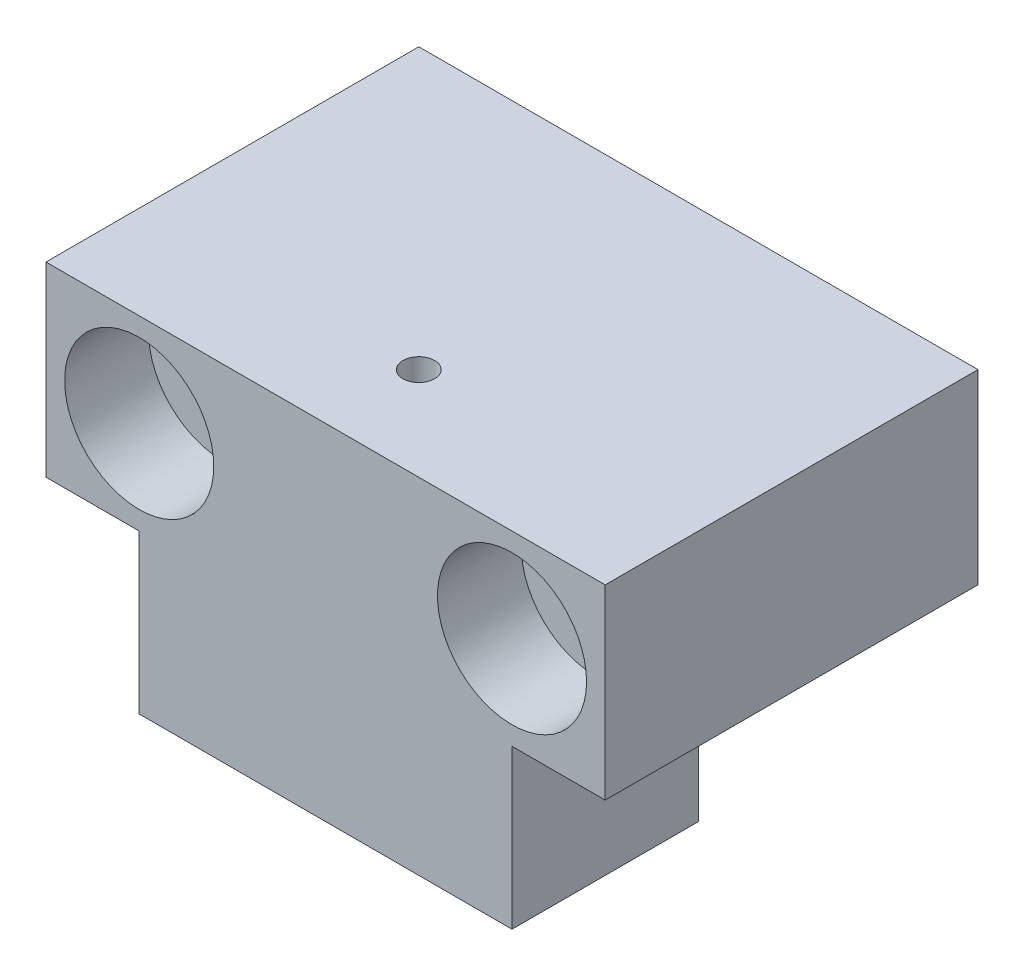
ISO-10303-21;
HEADER;
FILE_DESCRIPTION(('STEP AP214'),'2;1');
FILE_NAME('part.step','',(''),(''),'','','');
FILE_SCHEMA(('AUTOMOTIVE_DESIGN { 1 0 10303 214 1 1 1 1 }'));
ENDSEC;
DATA;
#1=APPLICATION_CONTEXT('core data for automotive mechanical design processes');
#2=APPLICATION_PROTOCOL_DEFINITION('international standard','automotive_design',2000,#1);
#3=PRODUCT_CONTEXT('',#1,'mechanical');
#4=PRODUCT('Part','Part','',(#3));
#5=PRODUCT_RELATED_PRODUCT_CATEGORY('part','',(#4));
#6=PRODUCT_DEFINITION_FORMATION('','',#4);
#7=PRODUCT_DEFINITION_CONTEXT('part definition',#1,'design');
#8=PRODUCT_DEFINITION('design','',#6,#7);
#9=PRODUCT_DEFINITION_SHAPE('','',#8);
#10=(LENGTH_UNIT() NAMED_UNIT(*) SI_UNIT(.MILLI.,.METRE.));
#11=(NAMED_UNIT(*) PLANE_ANGLE_UNIT() SI_UNIT($,.RADIAN.));
#12=(NAMED_UNIT(*) SI_UNIT($,.STERADIAN.) SOLID_ANGLE_UNIT());
#13=UNCERTAINTY_MEASURE_WITH_UNIT(LENGTH_MEASURE(1.E-05),#10,'distance_accuracy_value','');
#14=(GEOMETRIC_REPRESENTATION_CONTEXT(3) GLOBAL_UNCERTAINTY_ASSIGNED_CONTEXT((#13)) GLOBAL_UNIT_ASSIGNED_CONTEXT((#10,
#11,#12)) REPRESENTATION_CONTEXT('',''));
#15=CARTESIAN_POINT('',(0.,0.,0.));
#16=DIRECTION('',(0.,0.,1.));
#17=DIRECTION('',(1.,0.,0.));
#18=AXIS2_PLACEMENT_3D('',#15,#16,#17);
#19=CARTESIAN_POINT('',(25.0000000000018,13.5,20.));
#20=DIRECTION('',(0.,0.,-1.));
#21=DIRECTION('',(-1.,0.,0.));
#22=AXIS2_PLACEMENT_3D('',#19,#20,#21);
#23=CYLINDRICAL_SURFACE('',#22,2.25);
#24=CARTESIAN_POINT('',(25.0000000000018,13.5,0.));
#25=DIRECTION('',(0.,0.,1.));
#26=DIRECTION('',(1.,0.,0.));
#27=AXIS2_PLACEMENT_3D('',#24,#25,#26);
#28=CIRCLE('',#27,2.25);
#29=CARTESIAN_POINT('',(27.2500000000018,13.5,0.));
#30=VERTEX_POINT('',#29);
#31=EDGE_CURVE('E140',#30,#30,#28,.T.);
#32=ORIENTED_EDGE('',*,*,#31,.F.);
#33=EDGE_LOOP('',(#32));
#34=FACE_BOUND('',#33,.T.);
#35=CARTESIAN_POINT('',(25.0000000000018,13.5,15.5));
#36=DIRECTION('',(0.,0.,1.));
#37=DIRECTION('',(1.,0.,0.));
#38=AXIS2_PLACEMENT_3D('',#35,#36,#37);
#39=CIRCLE('',#38,2.25);
#40=CARTESIAN_POINT('',(27.2500000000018,13.5,15.5));
#41=VERTEX_POINT('',#40);
#42=EDGE_CURVE('E36',#41,#41,#39,.T.);
#43=ORIENTED_EDGE('',*,*,#42,.T.);
#44=EDGE_LOOP('',(#43));
#45=FACE_BOUND('',#44,.T.);
#46=ADVANCED_FACE('F32',(#34,#45),#23,.F.);
#47=CARTESIAN_POINT('',(5.00000000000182,13.5,20.));
#48=DIRECTION('',(0.,0.,-1.));
#49=DIRECTION('',(-1.,0.,0.));
#50=AXIS2_PLACEMENT_3D('',#47,#48,#49);
#51=CYLINDRICAL_SURFACE('',#50,2.25);
#52=CARTESIAN_POINT('',(5.00000000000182,13.5,0.));
#53=DIRECTION('',(0.,0.,1.));
#54=DIRECTION('',(1.,0.,0.));
#55=AXIS2_PLACEMENT_3D('',#52,#53,#54);
#56=CIRCLE('',#55,2.25);
#57=CARTESIAN_POINT('',(7.25000000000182,13.5,0.));
#58=VERTEX_POINT('',#57);
#59=EDGE_CURVE('E123',#58,#58,#56,.T.);
#60=ORIENTED_EDGE('',*,*,#59,.F.);
#61=EDGE_LOOP('',(#60));
#62=FACE_BOUND('',#61,.T.);
#63=CARTESIAN_POINT('',(5.00000000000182,13.5,15.5));
#64=DIRECTION('',(0.,0.,1.));
#65=DIRECTION('',(1.,0.,0.));
#66=AXIS2_PLACEMENT_3D('',#63,#64,#65);
#67=CIRCLE('',#66,2.25);
#68=CARTESIAN_POINT('',(7.25000000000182,13.5,15.5));
#69=VERTEX_POINT('',#68);
#70=EDGE_CURVE('E138',#69,#69,#67,.T.);
#71=ORIENTED_EDGE('',*,*,#70,.T.);
#72=EDGE_LOOP('',(#71));
#73=FACE_BOUND('',#72,.T.);
#74=ADVANCED_FACE('F221',(#62,#73),#51,.F.);
#75=CARTESIAN_POINT('',(1.81898940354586E-12,18.5,20.));
#76=DIRECTION('',(0.,0.,-1.));
#77=DIRECTION('',(-1.,0.,0.));
#78=AXIS2_PLACEMENT_3D('',#75,#76,#77);
#79=PLANE('',#78);
#80=CARTESIAN_POINT('',(25.0000000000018,13.5,20.));
#81=DIRECTION('',(0.,0.,1.));
#82=DIRECTION('',(1.,0.,0.));
#83=AXIS2_PLACEMENT_3D('',#80,#81,#82);
#84=CIRCLE('',#83,4.);
#85=CARTESIAN_POINT('',(29.0000000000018,13.5,20.));
#86=VERTEX_POINT('',#85);
#87=EDGE_CURVE('E154',#86,#86,#84,.T.);
#88=ORIENTED_EDGE('',*,*,#87,.F.);
#89=EDGE_LOOP('',(#88));
#90=FACE_BOUND('',#89,.T.);
#91=CARTESIAN_POINT('',(5.00000000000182,13.5,20.));
#92=DIRECTION('',(0.,0.,1.));
#93=DIRECTION('',(1.,0.,0.));
#94=AXIS2_PLACEMENT_3D('',#91,#92,#93);
#95=CIRCLE('',#94,4.);
#96=CARTESIAN_POINT('',(9.00000000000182,13.5,20.));
#97=VERTEX_POINT('',#96);
#98=EDGE_CURVE('E147',#97,#97,#95,.T.);
#99=ORIENTED_EDGE('',*,*,#98,.F.);
#100=EDGE_LOOP('',(#99));
#101=FACE_BOUND('',#100,.T.);
#102=DIRECTION('',(0.,-1.,0.));
#103=VECTOR('',#102,1.);
#104=CARTESIAN_POINT('',(1.81898940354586E-12,8.5,20.));
#105=LINE('',#104,#103);
#106=CARTESIAN_POINT('',(1.81898940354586E-12,18.5,20.));
#107=VERTEX_POINT('',#106);
#108=CARTESIAN_POINT('',(1.81898940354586E-12,8.5,20.));
#109=VERTEX_POINT('',#108);
#110=EDGE_CURVE('E127',#107,#109,#105,.T.);
#111=ORIENTED_EDGE('',*,*,#110,.T.);
#112=DIRECTION('',(1.,0.,0.));
#113=VECTOR('',#112,1.);
#114=CARTESIAN_POINT('',(1.81898940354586E-12,8.5,20.));
#115=LINE('',#114,#113);
#116=CARTESIAN_POINT('',(5.00000000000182,8.5,20.));
#117=VERTEX_POINT('',#116);
#118=EDGE_CURVE('E81',#109,#117,#115,.T.);
#119=ORIENTED_EDGE('',*,*,#118,.T.);
#120=DIRECTION('',(0.,-1.,0.));
#121=VECTOR('',#120,1.);
#122=CARTESIAN_POINT('',(5.00000000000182,0.,20.));
#123=LINE('',#122,#121);
#124=CARTESIAN_POINT('',(5.00000000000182,0.,20.));
#125=VERTEX_POINT('',#124);
#126=EDGE_CURVE('E161',#117,#125,#123,.T.);
#127=ORIENTED_EDGE('',*,*,#126,.T.);
#128=DIRECTION('',(1.,0.,0.));
#129=VECTOR('',#128,1.);
#130=CARTESIAN_POINT('',(5.00000000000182,0.,20.));
#131=LINE('',#130,#129);
#132=CARTESIAN_POINT('',(25.0000000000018,0.,20.));
#133=VERTEX_POINT('',#132);
#134=EDGE_CURVE('E163',#125,#133,#131,.T.);
#135=ORIENTED_EDGE('',*,*,#134,.T.);
#136=DIRECTION('',(0.,1.,0.));
#137=VECTOR('',#136,1.);
#138=CARTESIAN_POINT('',(25.0000000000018,0.,20.));
#139=LINE('',#138,#137);
#140=CARTESIAN_POINT('',(25.0000000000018,8.5,20.));
#141=VERTEX_POINT('',#140);
#142=EDGE_CURVE('E102',#133,#141,#139,.T.);
#143=ORIENTED_EDGE('',*,*,#142,.T.);
#144=DIRECTION('',(1.,0.,0.));
#145=VECTOR('',#144,1.);
#146=CARTESIAN_POINT('',(25.0000000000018,8.5,20.));
#147=LINE('',#146,#145);
#148=CARTESIAN_POINT('',(30.0000000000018,8.5,20.));
#149=VERTEX_POINT('',#148);
#150=EDGE_CURVE('E96',#141,#149,#147,.T.);
#151=ORIENTED_EDGE('',*,*,#150,.T.);
#152=DIRECTION('',(0.,1.,0.));
#153=VECTOR('',#152,1.);
#154=CARTESIAN_POINT('',(30.0000000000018,8.5,20.));
#155=LINE('',#154,#153);
#156=CARTESIAN_POINT('',(30.0000000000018,18.5,20.));
#157=VERTEX_POINT('',#156);
#158=EDGE_CURVE('E100',#149,#157,#155,.T.);
#159=ORIENTED_EDGE('',*,*,#158,.T.);
#160=DIRECTION('',(-1.,0.,0.));
#161=VECTOR('',#160,1.);
#162=CARTESIAN_POINT('',(1.81898940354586E-12,18.5,20.));
#163=LINE('',#162,#161);
#164=EDGE_CURVE('E51',#157,#107,#163,.T.);
#165=ORIENTED_EDGE('',*,*,#164,.T.);
#166=EDGE_LOOP('',(#111,#119,#127,#135,#143,#151,#159,#165));
#167=FACE_BOUND('',#166,.T.);
#168=ADVANCED_FACE('F98',(#90,#101,#167),#79,.F.);
#169=CARTESIAN_POINT('',(1.81898940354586E-12,18.5,0.));
#170=DIRECTION('',(0.,0.,-1.));
#171=DIRECTION('',(-1.,0.,0.));
#172=AXIS2_PLACEMENT_3D('',#169,#170,#171);
#173=PLANE('',#172);
#174=DIRECTION('',(1.,0.,0.));
#175=VECTOR('',#174,1.);
#176=CARTESIAN_POINT('',(25.0000000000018,8.5,0.));
#177=LINE('',#176,#175);
#178=CARTESIAN_POINT('',(1.81898940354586E-12,8.5,0.));
#179=VERTEX_POINT('',#178);
#180=CARTESIAN_POINT('',(30.0000000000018,8.5,0.));
#181=VERTEX_POINT('',#180);
#182=EDGE_CURVE('E110',#179,#181,#177,.T.);
#183=ORIENTED_EDGE('',*,*,#182,.F.);
#184=DIRECTION('',(0.,-1.,0.));
#185=VECTOR('',#184,1.);
#186=CARTESIAN_POINT('',(1.81898940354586E-12,8.5,0.));
#187=LINE('',#186,#185);
#188=CARTESIAN_POINT('',(1.81898940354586E-12,18.5,0.));
#189=VERTEX_POINT('',#188);
#190=EDGE_CURVE('E120',#189,#179,#187,.T.);
#191=ORIENTED_EDGE('',*,*,#190,.F.);
#192=DIRECTION('',(-1.,0.,0.));
#193=VECTOR('',#192,1.);
#194=CARTESIAN_POINT('',(1.81898940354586E-12,18.5,0.));
#195=LINE('',#194,#193);
#196=CARTESIAN_POINT('',(30.0000000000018,18.5,0.));
#197=VERTEX_POINT('',#196);
#198=EDGE_CURVE('E73',#197,#189,#195,.T.);
#199=ORIENTED_EDGE('',*,*,#198,.F.);
#200=DIRECTION('',(0.,1.,0.));
#201=VECTOR('',#200,1.);
#202=CARTESIAN_POINT('',(30.0000000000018,8.5,0.));
#203=LINE('',#202,#201);
#204=EDGE_CURVE('E67',#181,#197,#203,.T.);
#205=ORIENTED_EDGE('',*,*,#204,.F.);
#206=EDGE_LOOP('',(#183,#191,#199,#205));
#207=FACE_BOUND('',#206,.T.);
#208=ORIENTED_EDGE('',*,*,#59,.T.);
#209=EDGE_LOOP('',(#208));
#210=FACE_BOUND('',#209,.T.);
#211=ORIENTED_EDGE('',*,*,#31,.T.);
#212=EDGE_LOOP('',(#211));
#213=FACE_BOUND('',#212,.T.);
#214=ADVANCED_FACE('F236',(#207,#210,#213),#173,.T.);
#215=CARTESIAN_POINT('',(1.81898940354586E-12,8.5,20.));
#216=DIRECTION('',(1.,0.,0.));
#217=DIRECTION('',(0.,0.,-1.));
#218=AXIS2_PLACEMENT_3D('',#215,#216,#217);
#219=PLANE('',#218);
#220=ORIENTED_EDGE('',*,*,#190,.T.);
#221=DIRECTION('',(0.,0.,-1.));
#222=VECTOR('',#221,1.);
#223=CARTESIAN_POINT('',(1.81898940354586E-12,8.5,20.));
#224=LINE('',#223,#222);
#225=EDGE_CURVE('E11',#109,#179,#224,.T.);
#226=ORIENTED_EDGE('',*,*,#225,.F.);
#227=ORIENTED_EDGE('',*,*,#110,.F.);
#228=DIRECTION('',(0.,0.,-1.));
#229=VECTOR('',#228,1.);
#230=CARTESIAN_POINT('',(1.81898940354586E-12,18.5,20.));
#231=LINE('',#230,#229);
#232=EDGE_CURVE('E116',#107,#189,#231,.T.);
#233=ORIENTED_EDGE('',*,*,#232,.T.);
#234=EDGE_LOOP('',(#220,#226,#227,#233));
#235=FACE_BOUND('',#234,.T.);
#236=ADVANCED_FACE('F34',(#235),#219,.F.);
#237=CARTESIAN_POINT('',(5.00000000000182,0.,20.));
#238=DIRECTION('',(1.,0.,0.));
#239=DIRECTION('',(0.,0.,-1.));
#240=AXIS2_PLACEMENT_3D('',#237,#238,#239);
#241=PLANE('',#240);
#242=DIRECTION('',(0.,0.,-1.));
#243=VECTOR('',#242,1.);
#244=CARTESIAN_POINT('',(5.00000000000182,8.5,20.));
#245=LINE('',#244,#243);
#246=CARTESIAN_POINT('',(5.00000000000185,8.5,10.0000000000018));
#247=VERTEX_POINT('',#246);
#248=EDGE_CURVE('E42',#117,#247,#245,.T.);
#249=ORIENTED_EDGE('',*,*,#248,.T.);
#250=DIRECTION('',(0.,-1.,0.));
#251=VECTOR('',#250,1.);
#252=CARTESIAN_POINT('',(5.00000000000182,0.,10.0000000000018));
#253=LINE('',#252,#251);
#254=CARTESIAN_POINT('',(5.00000000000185,0.,10.0000000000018));
#255=VERTEX_POINT('',#254);
#256=EDGE_CURVE('E190',#247,#255,#253,.T.);
#257=ORIENTED_EDGE('',*,*,#256,.T.);
#258=DIRECTION('',(0.,0.,-1.));
#259=VECTOR('',#258,1.);
#260=CARTESIAN_POINT('',(5.00000000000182,0.,20.));
#261=LINE('',#260,#259);
#262=EDGE_CURVE('E134',#125,#255,#261,.T.);
#263=ORIENTED_EDGE('',*,*,#262,.F.);
#264=ORIENTED_EDGE('',*,*,#126,.F.);
#265=EDGE_LOOP('',(#249,#257,#263,#264));
#266=FACE_BOUND('',#265,.T.);
#267=ADVANCED_FACE('F194',(#266),#241,.F.);
#268=CARTESIAN_POINT('',(5.00000000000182,0.,20.));
#269=DIRECTION('',(0.,1.,0.));
#270=DIRECTION('',(0.,0.,1.));
#271=AXIS2_PLACEMENT_3D('',#268,#269,#270);
#272=PLANE('',#271);
#273=CARTESIAN_POINT('',(15.,0.,15.));
#274=DIRECTION('',(0.,1.,0.));
#275=DIRECTION('',(0.,0.,1.));
#276=AXIS2_PLACEMENT_3D('',#273,#274,#275);
#277=CIRCLE('',#276,0.85);
#278=CARTESIAN_POINT('',(15.,0.,15.85));
#279=VERTEX_POINT('',#278);
#280=EDGE_CURVE('E191',#279,#279,#277,.T.);
#281=ORIENTED_EDGE('',*,*,#280,.T.);
#282=EDGE_LOOP('',(#281));
#283=FACE_BOUND('',#282,.T.);
#284=ORIENTED_EDGE('',*,*,#262,.T.);
#285=DIRECTION('',(-1.,0.,0.));
#286=VECTOR('',#285,1.);
#287=CARTESIAN_POINT('',(84.0933547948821,0.,10.0000000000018));
#288=LINE('',#287,#286);
#289=CARTESIAN_POINT('',(25.0000000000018,0.,10.0000000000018));
#290=VERTEX_POINT('',#289);
#291=EDGE_CURVE('E173',#290,#255,#288,.T.);
#292=ORIENTED_EDGE('',*,*,#291,.F.);
#293=DIRECTION('',(0.,0.,-1.));
#294=VECTOR('',#293,1.);
#295=CARTESIAN_POINT('',(25.0000000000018,0.,20.));
#296=LINE('',#295,#294);
#297=EDGE_CURVE('E131',#133,#290,#296,.T.);
#298=ORIENTED_EDGE('',*,*,#297,.F.);
#299=ORIENTED_EDGE('',*,*,#134,.F.);
#300=EDGE_LOOP('',(#284,#292,#298,#299));
#301=FACE_BOUND('',#300,.T.);
#302=ADVANCED_FACE('F170',(#283,#301),#272,.F.);
#303=CARTESIAN_POINT('',(25.0000000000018,0.,20.));
#304=DIRECTION('',(-1.,0.,0.));
#305=DIRECTION('',(0.,0.,1.));
#306=AXIS2_PLACEMENT_3D('',#303,#304,#305);
#307=PLANE('',#306);
#308=ORIENTED_EDGE('',*,*,#297,.T.);
#309=DIRECTION('',(0.,1.,0.));
#310=VECTOR('',#309,1.);
#311=CARTESIAN_POINT('',(25.0000000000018,0.,10.0000000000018));
#312=LINE('',#311,#310);
#313=CARTESIAN_POINT('',(25.0000000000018,8.5,10.0000000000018));
#314=VERTEX_POINT('',#313);
#315=EDGE_CURVE('E179',#290,#314,#312,.T.);
#316=ORIENTED_EDGE('',*,*,#315,.T.);
#317=DIRECTION('',(0.,0.,-1.));
#318=VECTOR('',#317,1.);
#319=CARTESIAN_POINT('',(25.0000000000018,8.5,20.));
#320=LINE('',#319,#318);
#321=EDGE_CURVE('E111',#141,#314,#320,.T.);
#322=ORIENTED_EDGE('',*,*,#321,.F.);
#323=ORIENTED_EDGE('',*,*,#142,.F.);
#324=EDGE_LOOP('',(#308,#316,#322,#323));
#325=FACE_BOUND('',#324,.T.);
#326=ADVANCED_FACE('F176',(#325),#307,.F.);
#327=CARTESIAN_POINT('',(25.0000000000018,8.5,20.));
#328=DIRECTION('',(0.,1.,0.));
#329=DIRECTION('',(0.,0.,1.));
#330=AXIS2_PLACEMENT_3D('',#327,#328,#329);
#331=PLANE('',#330);
#332=ORIENTED_EDGE('',*,*,#321,.T.);
#333=DIRECTION('',(-1.,0.,0.));
#334=VECTOR('',#333,1.);
#335=CARTESIAN_POINT('',(84.0933547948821,8.5,10.0000000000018));
#336=LINE('',#335,#334);
#337=EDGE_CURVE('E183',#314,#247,#336,.T.);
#338=ORIENTED_EDGE('',*,*,#337,.T.);
#339=ORIENTED_EDGE('',*,*,#248,.F.);
#340=ORIENTED_EDGE('',*,*,#118,.F.);
#341=ORIENTED_EDGE('',*,*,#225,.T.);
#342=ORIENTED_EDGE('',*,*,#182,.T.);
#343=DIRECTION('',(0.,0.,-1.));
#344=VECTOR('',#343,1.);
#345=CARTESIAN_POINT('',(30.0000000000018,8.5,20.));
#346=LINE('',#345,#344);
#347=EDGE_CURVE('E107',#149,#181,#346,.T.);
#348=ORIENTED_EDGE('',*,*,#347,.F.);
#349=ORIENTED_EDGE('',*,*,#150,.F.);
#350=EDGE_LOOP('',(#332,#338,#339,#340,#341,#342,#348,#349));
#351=FACE_BOUND('',#350,.T.);
#352=ADVANCED_FACE('F108',(#351),#331,.F.);
#353=CARTESIAN_POINT('',(30.0000000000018,8.5,20.));
#354=DIRECTION('',(-1.,0.,0.));
#355=DIRECTION('',(0.,0.,1.));
#356=AXIS2_PLACEMENT_3D('',#353,#354,#355);
#357=PLANE('',#356);
#358=ORIENTED_EDGE('',*,*,#204,.T.);
#359=DIRECTION('',(0.,0.,-1.));
#360=VECTOR('',#359,1.);
#361=CARTESIAN_POINT('',(30.0000000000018,18.5,20.));
#362=LINE('',#361,#360);
#363=EDGE_CURVE('E112',#157,#197,#362,.T.);
#364=ORIENTED_EDGE('',*,*,#363,.F.);
#365=ORIENTED_EDGE('',*,*,#158,.F.);
#366=ORIENTED_EDGE('',*,*,#347,.T.);
#367=EDGE_LOOP('',(#358,#364,#365,#366));
#368=FACE_BOUND('',#367,.T.);
#369=ADVANCED_FACE('F114',(#368),#357,.F.);
#370=CARTESIAN_POINT('',(1.81898940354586E-12,18.5,20.));
#371=DIRECTION('',(0.,-1.,0.));
#372=DIRECTION('',(0.,0.,-1.));
#373=AXIS2_PLACEMENT_3D('',#370,#371,#372);
#374=PLANE('',#373);
#375=CARTESIAN_POINT('',(15.,18.5,15.));
#376=DIRECTION('',(0.,1.,0.));
#377=DIRECTION('',(0.,0.,1.));
#378=AXIS2_PLACEMENT_3D('',#375,#376,#377);
#379=CIRCLE('',#378,0.85);
#380=CARTESIAN_POINT('',(15.,18.5,15.85));
#381=VERTEX_POINT('',#380);
#382=EDGE_CURVE('E378',#381,#381,#379,.T.);
#383=ORIENTED_EDGE('',*,*,#382,.F.);
#384=EDGE_LOOP('',(#383));
#385=FACE_BOUND('',#384,.T.);
#386=ORIENTED_EDGE('',*,*,#198,.T.);
#387=ORIENTED_EDGE('',*,*,#232,.F.);
#388=ORIENTED_EDGE('',*,*,#164,.F.);
#389=ORIENTED_EDGE('',*,*,#363,.T.);
#390=EDGE_LOOP('',(#386,#387,#388,#389));
#391=FACE_BOUND('',#390,.T.);
#392=ADVANCED_FACE('F241',(#385,#391),#374,.F.);
#393=CARTESIAN_POINT('',(5.00000000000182,13.5,15.5));
#394=DIRECTION('',(0.,0.,1.));
#395=DIRECTION('',(1.,0.,0.));
#396=AXIS2_PLACEMENT_3D('',#393,#394,#395);
#397=CYLINDRICAL_SURFACE('',#396,4.);
#398=CARTESIAN_POINT('',(5.00000000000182,13.5,15.5));
#399=DIRECTION('',(0.,0.,1.));
#400=DIRECTION('',(1.,0.,0.));
#401=AXIS2_PLACEMENT_3D('',#398,#399,#400);
#402=CIRCLE('',#401,4.);
#403=CARTESIAN_POINT('',(9.00000000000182,13.5,15.5));
#404=VERTEX_POINT('',#403);
#405=EDGE_CURVE('E141',#404,#404,#402,.T.);
#406=ORIENTED_EDGE('',*,*,#405,.F.);
#407=EDGE_LOOP('',(#406));
#408=FACE_BOUND('',#407,.T.);
#409=ORIENTED_EDGE('',*,*,#98,.T.);
#410=EDGE_LOOP('',(#409));
#411=FACE_BOUND('',#410,.T.);
#412=ADVANCED_FACE('F231',(#408,#411),#397,.F.);
#413=CARTESIAN_POINT('',(5.00000000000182,13.5,15.5));
#414=DIRECTION('',(0.,0.,1.));
#415=DIRECTION('',(1.,0.,0.));
#416=AXIS2_PLACEMENT_3D('',#413,#414,#415);
#417=PLANE('',#416);
#418=ORIENTED_EDGE('',*,*,#70,.F.);
#419=EDGE_LOOP('',(#418));
#420=FACE_BOUND('',#419,.T.);
#421=ORIENTED_EDGE('',*,*,#405,.T.);
#422=EDGE_LOOP('',(#421));
#423=FACE_BOUND('',#422,.T.);
#424=ADVANCED_FACE('F217',(#420,#423),#417,.T.);
#425=CARTESIAN_POINT('',(25.0000000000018,13.5,15.5));
#426=DIRECTION('',(0.,0.,1.));
#427=DIRECTION('',(1.,0.,0.));
#428=AXIS2_PLACEMENT_3D('',#425,#426,#427);
#429=CYLINDRICAL_SURFACE('',#428,4.);
#430=CARTESIAN_POINT('',(25.0000000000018,13.5,15.5));
#431=DIRECTION('',(0.,0.,1.));
#432=DIRECTION('',(1.,0.,0.));
#433=AXIS2_PLACEMENT_3D('',#430,#431,#432);
#434=CIRCLE('',#433,4.);
#435=CARTESIAN_POINT('',(29.0000000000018,13.5,15.5));
#436=VERTEX_POINT('',#435);
#437=EDGE_CURVE('E197',#436,#436,#434,.T.);
#438=ORIENTED_EDGE('',*,*,#437,.F.);
#439=EDGE_LOOP('',(#438));
#440=FACE_BOUND('',#439,.T.);
#441=ORIENTED_EDGE('',*,*,#87,.T.);
#442=EDGE_LOOP('',(#441));
#443=FACE_BOUND('',#442,.T.);
#444=ADVANCED_FACE('F209',(#440,#443),#429,.F.);
#445=CARTESIAN_POINT('',(25.0000000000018,13.5,15.5));
#446=DIRECTION('',(0.,0.,1.));
#447=DIRECTION('',(1.,0.,0.));
#448=AXIS2_PLACEMENT_3D('',#445,#446,#447);
#449=PLANE('',#448);
#450=ORIENTED_EDGE('',*,*,#42,.F.);
#451=EDGE_LOOP('',(#450));
#452=FACE_BOUND('',#451,.T.);
#453=ORIENTED_EDGE('',*,*,#437,.T.);
#454=EDGE_LOOP('',(#453));
#455=FACE_BOUND('',#454,.T.);
#456=ADVANCED_FACE('F207',(#452,#455),#449,.T.);
#457=CARTESIAN_POINT('',(84.0933547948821,0.,10.0000000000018));
#458=DIRECTION('',(0.,0.,1.));
#459=DIRECTION('',(1.,0.,0.));
#460=AXIS2_PLACEMENT_3D('',#457,#458,#459);
#461=PLANE('',#460);
#462=ORIENTED_EDGE('',*,*,#256,.F.);
#463=ORIENTED_EDGE('',*,*,#337,.F.);
#464=ORIENTED_EDGE('',*,*,#315,.F.);
#465=ORIENTED_EDGE('',*,*,#291,.T.);
#466=EDGE_LOOP('',(#462,#463,#464,#465));
#467=FACE_BOUND('',#466,.T.);
#468=ADVANCED_FACE('F189',(#467),#461,.F.);
#469=CARTESIAN_POINT('',(15.,0.,15.));
#470=DIRECTION('',(0.,1.,0.));
#471=DIRECTION('',(0.,0.,1.));
#472=AXIS2_PLACEMENT_3D('',#469,#470,#471);
#473=CYLINDRICAL_SURFACE('',#472,0.85);
#474=ORIENTED_EDGE('',*,*,#280,.F.);
#475=EDGE_LOOP('',(#474));
#476=FACE_BOUND('',#475,.T.);
#477=ORIENTED_EDGE('',*,*,#382,.T.);
#478=EDGE_LOOP('',(#477));
#479=FACE_BOUND('',#478,.T.);
#480=ADVANCED_FACE('F215',(#476,#479),#473,.F.);
#481=CLOSED_SHELL('',(#46,#74,#168,#214,#236,#267,#302,#326,#352,#369,#392,#412,#424,#444,#456,
#468,#480));
#482=MANIFOLD_SOLID_BREP('B2',#481);
#483=ADVANCED_BREP_SHAPE_REPRESENTATION('',(#18,#482),#14);
#484=SHAPE_DEFINITION_REPRESENTATION(#9,#483);
ENDSEC;
END-ISO-10303-21;
